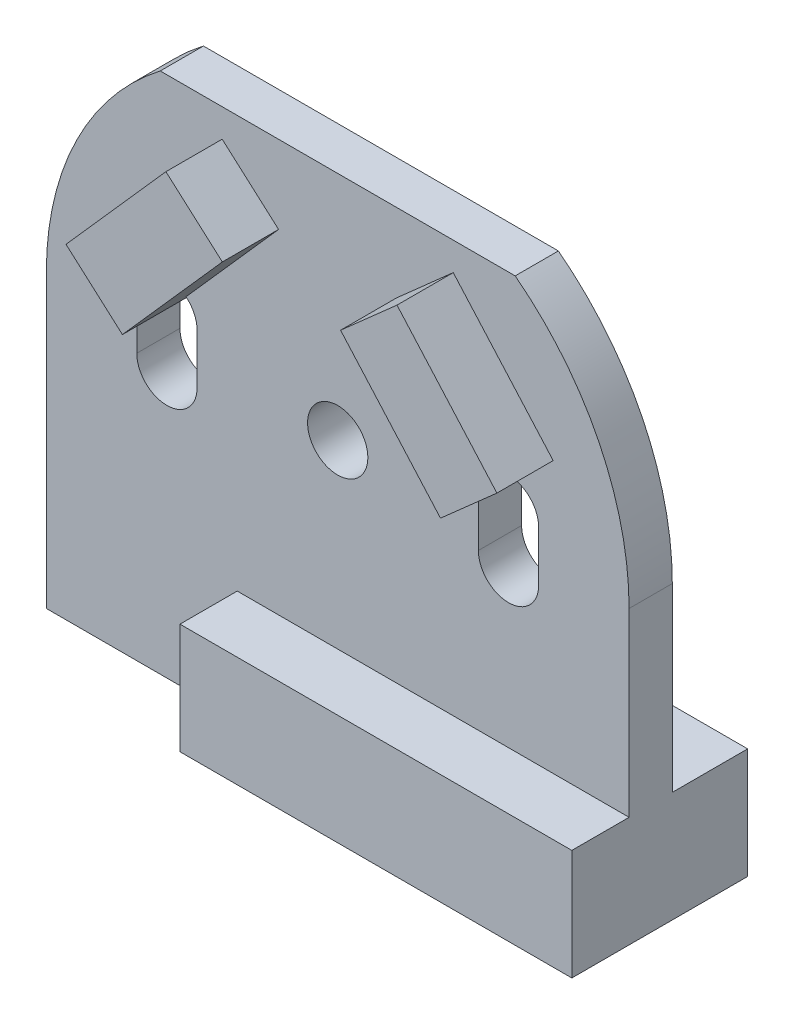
ISO-10303-21;
HEADER;
FILE_DESCRIPTION(('STEP AP214'),'2;1');
FILE_NAME('part.step','',(''),(''),'','','');
FILE_SCHEMA(('AUTOMOTIVE_DESIGN { 1 0 10303 214 1 1 1 1 }'));
ENDSEC;
DATA;
#1=APPLICATION_CONTEXT('core data for automotive mechanical design processes');
#2=APPLICATION_PROTOCOL_DEFINITION('international standard','automotive_design',2000,#1);
#3=PRODUCT_CONTEXT('',#1,'mechanical');
#4=PRODUCT('Part','Part','',(#3));
#5=PRODUCT_RELATED_PRODUCT_CATEGORY('part','',(#4));
#6=PRODUCT_DEFINITION_FORMATION('','',#4);
#7=PRODUCT_DEFINITION_CONTEXT('part definition',#1,'design');
#8=PRODUCT_DEFINITION('design','',#6,#7);
#9=PRODUCT_DEFINITION_SHAPE('','',#8);
#10=(LENGTH_UNIT() NAMED_UNIT(*) SI_UNIT(.MILLI.,.METRE.));
#11=(NAMED_UNIT(*) PLANE_ANGLE_UNIT() SI_UNIT($,.RADIAN.));
#12=(NAMED_UNIT(*) SI_UNIT($,.STERADIAN.) SOLID_ANGLE_UNIT());
#13=UNCERTAINTY_MEASURE_WITH_UNIT(LENGTH_MEASURE(1.E-05),#10,'distance_accuracy_value','');
#14=(GEOMETRIC_REPRESENTATION_CONTEXT(3) GLOBAL_UNCERTAINTY_ASSIGNED_CONTEXT((#13)) GLOBAL_UNIT_ASSIGNED_CONTEXT((#10,
#11,#12)) REPRESENTATION_CONTEXT('',''));
#15=CARTESIAN_POINT('',(0.,0.,0.));
#16=DIRECTION('',(0.,0.,1.));
#17=DIRECTION('',(1.,0.,0.));
#18=AXIS2_PLACEMENT_3D('',#15,#16,#17);
#19=CARTESIAN_POINT('',(3.4,0.5,0.86));
#20=DIRECTION('',(0.,0.,-1.));
#21=DIRECTION('',(-1.,0.,0.));
#22=AXIS2_PLACEMENT_3D('',#19,#20,#21);
#23=CYLINDRICAL_SURFACE('',#22,0.6);
#24=DIRECTION('',(0.,0.,-1.));
#25=VECTOR('',#24,1.);
#26=CARTESIAN_POINT('',(3.01971988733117,0.964098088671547,0.86));
#27=LINE('',#26,#25);
#28=CARTESIAN_POINT('',(3.01971988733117,0.964098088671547,0.86));
#29=VERTEX_POINT('',#28);
#30=CARTESIAN_POINT('',(3.01971988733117,0.964098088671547,0.));
#31=VERTEX_POINT('',#30);
#32=EDGE_CURVE('E363',#29,#31,#27,.T.);
#33=ORIENTED_EDGE('',*,*,#32,.F.);
#34=CARTESIAN_POINT('',(3.4,0.5,0.86));
#35=DIRECTION('',(0.,0.,1.));
#36=DIRECTION('',(1.,0.,0.));
#37=AXIS2_PLACEMENT_3D('',#34,#35,#36);
#38=CIRCLE('',#37,0.6);
#39=CARTESIAN_POINT('',(2.8,0.5,0.86));
#40=VERTEX_POINT('',#39);
#41=EDGE_CURVE('E453',#29,#40,#38,.T.);
#42=ORIENTED_EDGE('',*,*,#41,.T.);
#43=DIRECTION('',(0.,0.,-1.));
#44=VECTOR('',#43,1.);
#45=CARTESIAN_POINT('',(2.8,0.5,0.86));
#46=LINE('',#45,#44);
#47=CARTESIAN_POINT('',(2.8,0.5,0.));
#48=VERTEX_POINT('',#47);
#49=EDGE_CURVE('E566',#40,#48,#46,.T.);
#50=ORIENTED_EDGE('',*,*,#49,.T.);
#51=CARTESIAN_POINT('',(3.4,0.5,0.));
#52=DIRECTION('',(0.,0.,1.));
#53=DIRECTION('',(1.,0.,0.));
#54=AXIS2_PLACEMENT_3D('',#51,#52,#53);
#55=CIRCLE('',#54,0.6);
#56=EDGE_CURVE('E508',#31,#48,#55,.T.);
#57=ORIENTED_EDGE('',*,*,#56,.F.);
#58=EDGE_LOOP('',(#33,#42,#50,#57));
#59=FACE_BOUND('',#58,.T.);
#60=ADVANCED_FACE('F41',(#59),#23,.F.);
#61=CARTESIAN_POINT('',(-3.4,0.5,0.86));
#62=DIRECTION('',(0.,0.,-1.));
#63=DIRECTION('',(-1.,0.,0.));
#64=AXIS2_PLACEMENT_3D('',#61,#62,#63);
#65=CYLINDRICAL_SURFACE('',#64,0.6);
#66=CARTESIAN_POINT('',(-3.4,0.5,0.));
#67=DIRECTION('',(0.,0.,1.));
#68=DIRECTION('',(1.,0.,0.));
#69=AXIS2_PLACEMENT_3D('',#66,#67,#68);
#70=CIRCLE('',#69,0.6);
#71=CARTESIAN_POINT('',(-3.49641039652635,1.09220354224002,0.));
#72=VERTEX_POINT('',#71);
#73=CARTESIAN_POINT('',(-4.,0.5,0.));
#74=VERTEX_POINT('',#73);
#75=EDGE_CURVE('E428',#72,#74,#70,.T.);
#76=ORIENTED_EDGE('',*,*,#75,.F.);
#77=DIRECTION('',(0.,0.,-1.));
#78=VECTOR('',#77,1.);
#79=CARTESIAN_POINT('',(-3.49641039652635,1.09220354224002,0.86));
#80=LINE('',#79,#78);
#81=CARTESIAN_POINT('',(-3.49641039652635,1.09220354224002,0.86));
#82=VERTEX_POINT('',#81);
#83=EDGE_CURVE('E424',#72,#82,#80,.F.);
#84=ORIENTED_EDGE('',*,*,#83,.T.);
#85=CARTESIAN_POINT('',(-3.4,0.5,0.86));
#86=DIRECTION('',(0.,0.,1.));
#87=DIRECTION('',(1.,0.,0.));
#88=AXIS2_PLACEMENT_3D('',#85,#86,#87);
#89=CIRCLE('',#88,0.6);
#90=CARTESIAN_POINT('',(-4.,0.5,0.86));
#91=VERTEX_POINT('',#90);
#92=EDGE_CURVE('E434',#82,#91,#89,.T.);
#93=ORIENTED_EDGE('',*,*,#92,.T.);
#94=DIRECTION('',(0.,0.,-1.));
#95=VECTOR('',#94,1.);
#96=CARTESIAN_POINT('',(-4.,0.5,0.86));
#97=LINE('',#96,#95);
#98=EDGE_CURVE('E572',#91,#74,#97,.T.);
#99=ORIENTED_EDGE('',*,*,#98,.T.);
#100=EDGE_LOOP('',(#76,#84,#93,#99));
#101=FACE_BOUND('',#100,.T.);
#102=ADVANCED_FACE('F43',(#101),#65,.F.);
#103=CARTESIAN_POINT('',(-2.8,0.5,0.86));
#104=VERTEX_POINT('',#103);
#105=CARTESIAN_POINT('',(-3.01971988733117,0.964098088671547,0.86));
#106=VERTEX_POINT('',#105);
#107=EDGE_CURVE('E429',#104,#106,#89,.T.);
#108=ORIENTED_EDGE('',*,*,#107,.T.);
#109=DIRECTION('',(0.,0.,-1.));
#110=VECTOR('',#109,1.);
#111=CARTESIAN_POINT('',(-3.01971988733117,0.964098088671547,0.86));
#112=LINE('',#111,#110);
#113=CARTESIAN_POINT('',(-3.01971988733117,0.964098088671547,0.));
#114=VERTEX_POINT('',#113);
#115=EDGE_CURVE('E416',#106,#114,#112,.T.);
#116=ORIENTED_EDGE('',*,*,#115,.T.);
#117=CARTESIAN_POINT('',(-2.8,0.5,0.));
#118=VERTEX_POINT('',#117);
#119=EDGE_CURVE('E484',#118,#114,#70,.T.);
#120=ORIENTED_EDGE('',*,*,#119,.F.);
#121=DIRECTION('',(0.,0.,-1.));
#122=VECTOR('',#121,1.);
#123=CARTESIAN_POINT('',(-2.8,0.5,0.86));
#124=LINE('',#123,#122);
#125=EDGE_CURVE('E563',#104,#118,#124,.T.);
#126=ORIENTED_EDGE('',*,*,#125,.F.);
#127=EDGE_LOOP('',(#108,#116,#120,#126));
#128=FACE_BOUND('',#127,.T.);
#129=ADVANCED_FACE('F646',(#128),#65,.F.);
#130=CARTESIAN_POINT('',(0.,0.,0.86));
#131=DIRECTION('',(0.,0.,1.));
#132=DIRECTION('',(1.,0.,0.));
#133=AXIS2_PLACEMENT_3D('',#130,#131,#132);
#134=PLANE('',#133);
#135=DIRECTION('',(0.,-1.,0.));
#136=VECTOR('',#135,1.);
#137=CARTESIAN_POINT('',(-2.,0.,0.86));
#138=LINE('',#137,#136);
#139=CARTESIAN_POINT('',(-2.,-3.6,0.86));
#140=VERTEX_POINT('',#139);
#141=CARTESIAN_POINT('',(-2.,-5.8,0.86));
#142=VERTEX_POINT('',#141);
#143=EDGE_CURVE('E310',#140,#142,#138,.T.);
#144=ORIENTED_EDGE('',*,*,#143,.F.);
#145=DIRECTION('',(1.,0.,0.));
#146=VECTOR('',#145,1.);
#147=CARTESIAN_POINT('',(0.,-3.6,0.86));
#148=LINE('',#147,#146);
#149=CARTESIAN_POINT('',(5.8,-3.6,0.86));
#150=VERTEX_POINT('',#149);
#151=EDGE_CURVE('E307',#140,#150,#148,.T.);
#152=ORIENTED_EDGE('',*,*,#151,.T.);
#153=DIRECTION('',(0.,1.,0.));
#154=VECTOR('',#153,1.);
#155=CARTESIAN_POINT('',(5.8,0.,0.86));
#156=LINE('',#155,#154);
#157=CARTESIAN_POINT('',(5.8,0.,0.86));
#158=VERTEX_POINT('',#157);
#159=EDGE_CURVE('E481',#150,#158,#156,.T.);
#160=ORIENTED_EDGE('',*,*,#159,.T.);
#161=CARTESIAN_POINT('',(0.,0.,0.86));
#162=DIRECTION('',(0.,0.,1.));
#163=DIRECTION('',(1.,0.,0.));
#164=AXIS2_PLACEMENT_3D('',#161,#162,#163);
#165=CIRCLE('',#164,5.8);
#166=CARTESIAN_POINT('',(3.53270434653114,4.6,0.86));
#167=VERTEX_POINT('',#166);
#168=EDGE_CURVE('E473',#158,#167,#165,.T.);
#169=ORIENTED_EDGE('',*,*,#168,.T.);
#170=DIRECTION('',(1.,0.,0.));
#171=VECTOR('',#170,1.);
#172=CARTESIAN_POINT('',(0.,4.6,0.86));
#173=LINE('',#172,#171);
#174=CARTESIAN_POINT('',(-3.53270434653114,4.6,0.86));
#175=VERTEX_POINT('',#174);
#176=EDGE_CURVE('E465',#175,#167,#173,.T.);
#177=ORIENTED_EDGE('',*,*,#176,.F.);
#178=CARTESIAN_POINT('',(-5.8,0.,0.86));
#179=VERTEX_POINT('',#178);
#180=EDGE_CURVE('E469',#175,#179,#165,.T.);
#181=ORIENTED_EDGE('',*,*,#180,.T.);
#182=DIRECTION('',(0.,1.,0.));
#183=VECTOR('',#182,1.);
#184=CARTESIAN_POINT('',(-5.8,0.,0.86));
#185=LINE('',#184,#183);
#186=CARTESIAN_POINT('',(-5.8,-5.8,0.86));
#187=VERTEX_POINT('',#186);
#188=EDGE_CURVE('E472',#187,#179,#185,.T.);
#189=ORIENTED_EDGE('',*,*,#188,.F.);
#190=DIRECTION('',(1.,0.,0.));
#191=VECTOR('',#190,1.);
#192=CARTESIAN_POINT('',(0.,-5.8,0.86));
#193=LINE('',#192,#191);
#194=EDGE_CURVE('E477',#187,#142,#193,.T.);
#195=ORIENTED_EDGE('',*,*,#194,.T.);
#196=EDGE_LOOP('',(#144,#152,#160,#169,#177,#181,#189,#195));
#197=FACE_BOUND('',#196,.T.);
#198=DIRECTION('',(0.662893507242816,-0.74871369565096,0.));
#199=VECTOR('',#198,1.);
#200=CARTESIAN_POINT('',(2.17126971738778,1.92239117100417,0.86));
#201=LINE('',#200,#199);
#202=CARTESIAN_POINT('',(1.17692945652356,3.04546171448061,0.86));
#203=VERTEX_POINT('',#202);
#204=EDGE_CURVE('E367',#203,#29,#201,.T.);
#205=ORIENTED_EDGE('',*,*,#204,.F.);
#206=DIRECTION('',(-0.74871369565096,-0.662893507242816,0.));
#207=VECTOR('',#206,1.);
#208=CARTESIAN_POINT('',(-0.994340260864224,1.12307054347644,0.86));
#209=LINE('',#208,#207);
#210=CARTESIAN_POINT('',(2.3,4.03980197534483,0.86));
#211=VERTEX_POINT('',#210);
#212=EDGE_CURVE('E351',#211,#203,#209,.T.);
#213=ORIENTED_EDGE('',*,*,#212,.F.);
#214=DIRECTION('',(-0.662893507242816,0.74871369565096,0.));
#215=VECTOR('',#214,1.);
#216=CARTESIAN_POINT('',(3.29434026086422,2.91673143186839,0.86));
#217=LINE('',#216,#215);
#218=CARTESIAN_POINT('',(4.28868052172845,1.79366088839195,0.86));
#219=VERTEX_POINT('',#218);
#220=EDGE_CURVE('E354',#219,#211,#217,.T.);
#221=ORIENTED_EDGE('',*,*,#220,.F.);
#222=DIRECTION('',(0.74871369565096,0.662893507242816,0.));
#223=VECTOR('',#222,1.);
#224=CARTESIAN_POINT('',(0.994340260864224,-1.12307054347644,0.86));
#225=LINE('',#224,#223);
#226=CARTESIAN_POINT('',(3.49641039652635,1.09220354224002,0.86));
#227=VERTEX_POINT('',#226);
#228=EDGE_CURVE('E360',#227,#219,#225,.T.);
#229=ORIENTED_EDGE('',*,*,#228,.F.);
#230=CARTESIAN_POINT('',(4.,0.5,0.86));
#231=VERTEX_POINT('',#230);
#232=EDGE_CURVE('E454',#231,#227,#38,.T.);
#233=ORIENTED_EDGE('',*,*,#232,.F.);
#234=DIRECTION('',(0.,-1.,0.));
#235=VECTOR('',#234,1.);
#236=CARTESIAN_POINT('',(4.,0.,0.86));
#237=LINE('',#236,#235);
#238=CARTESIAN_POINT('',(4.,-0.5,0.86));
#239=VERTEX_POINT('',#238);
#240=EDGE_CURVE('E458',#231,#239,#237,.T.);
#241=ORIENTED_EDGE('',*,*,#240,.T.);
#242=CARTESIAN_POINT('',(3.4,-0.5,0.86));
#243=DIRECTION('',(0.,0.,1.));
#244=DIRECTION('',(1.,0.,0.));
#245=AXIS2_PLACEMENT_3D('',#242,#243,#244);
#246=CIRCLE('',#245,0.6);
#247=CARTESIAN_POINT('',(2.8,-0.5,0.86));
#248=VERTEX_POINT('',#247);
#249=EDGE_CURVE('E445',#248,#239,#246,.T.);
#250=ORIENTED_EDGE('',*,*,#249,.F.);
#251=DIRECTION('',(0.,-1.,0.));
#252=VECTOR('',#251,1.);
#253=CARTESIAN_POINT('',(2.8,0.,0.86));
#254=LINE('',#253,#252);
#255=EDGE_CURVE('E449',#40,#248,#254,.T.);
#256=ORIENTED_EDGE('',*,*,#255,.F.);
#257=ORIENTED_EDGE('',*,*,#41,.F.);
#258=EDGE_LOOP('',(#205,#213,#221,#229,#233,#241,#250,#256,#257));
#259=FACE_BOUND('',#258,.T.);
#260=CARTESIAN_POINT('',(0.,0.,0.86));
#261=DIRECTION('',(0.,0.,1.));
#262=DIRECTION('',(1.,0.,0.));
#263=AXIS2_PLACEMENT_3D('',#260,#261,#262);
#264=CIRCLE('',#263,0.6);
#265=CARTESIAN_POINT('',(0.6,0.,0.86));
#266=VERTEX_POINT('',#265);
#267=EDGE_CURVE('E461',#266,#266,#264,.T.);
#268=ORIENTED_EDGE('',*,*,#267,.F.);
#269=EDGE_LOOP('',(#268));
#270=FACE_BOUND('',#269,.T.);
#271=ORIENTED_EDGE('',*,*,#92,.F.);
#272=DIRECTION('',(-0.74871369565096,0.662893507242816,0.));
#273=VECTOR('',#272,1.);
#274=CARTESIAN_POINT('',(-0.994340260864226,-1.12307054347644,0.86));
#275=LINE('',#274,#273);
#276=CARTESIAN_POINT('',(-4.28868052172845,1.79366088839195,0.86));
#277=VERTEX_POINT('',#276);
#278=EDGE_CURVE('E420',#82,#277,#275,.T.);
#279=ORIENTED_EDGE('',*,*,#278,.T.);
#280=DIRECTION('',(0.662893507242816,0.74871369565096,0.));
#281=VECTOR('',#280,1.);
#282=CARTESIAN_POINT('',(-3.29434026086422,2.91673143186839,0.86));
#283=LINE('',#282,#281);
#284=CARTESIAN_POINT('',(-2.3,4.03980197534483,0.86));
#285=VERTEX_POINT('',#284);
#286=EDGE_CURVE('E404',#277,#285,#283,.T.);
#287=ORIENTED_EDGE('',*,*,#286,.T.);
#288=DIRECTION('',(0.748713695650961,-0.662893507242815,0.));
#289=VECTOR('',#288,1.);
#290=CARTESIAN_POINT('',(0.994340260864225,1.12307054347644,0.86));
#291=LINE('',#290,#289);
#292=CARTESIAN_POINT('',(-1.17692945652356,3.04546171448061,0.86));
#293=VERTEX_POINT('',#292);
#294=EDGE_CURVE('E408',#285,#293,#291,.T.);
#295=ORIENTED_EDGE('',*,*,#294,.T.);
#296=DIRECTION('',(-0.662893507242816,-0.74871369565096,0.));
#297=VECTOR('',#296,1.);
#298=CARTESIAN_POINT('',(-2.17126971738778,1.92239117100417,0.86));
#299=LINE('',#298,#297);
#300=EDGE_CURVE('E412',#293,#106,#299,.T.);
#301=ORIENTED_EDGE('',*,*,#300,.T.);
#302=ORIENTED_EDGE('',*,*,#107,.F.);
#303=DIRECTION('',(0.,-1.,0.));
#304=VECTOR('',#303,1.);
#305=CARTESIAN_POINT('',(-2.8,0.,0.86));
#306=LINE('',#305,#304);
#307=CARTESIAN_POINT('',(-2.8,-0.5,0.86));
#308=VERTEX_POINT('',#307);
#309=EDGE_CURVE('E433',#104,#308,#306,.T.);
#310=ORIENTED_EDGE('',*,*,#309,.T.);
#311=CARTESIAN_POINT('',(-3.4,-0.5,0.86));
#312=DIRECTION('',(0.,0.,1.));
#313=DIRECTION('',(1.,0.,0.));
#314=AXIS2_PLACEMENT_3D('',#311,#312,#313);
#315=CIRCLE('',#314,0.6);
#316=CARTESIAN_POINT('',(-4.,-0.5,0.86));
#317=VERTEX_POINT('',#316);
#318=EDGE_CURVE('E437',#317,#308,#315,.T.);
#319=ORIENTED_EDGE('',*,*,#318,.F.);
#320=DIRECTION('',(0.,-1.,0.));
#321=VECTOR('',#320,1.);
#322=CARTESIAN_POINT('',(-4.,0.,0.86));
#323=LINE('',#322,#321);
#324=EDGE_CURVE('E441',#91,#317,#323,.T.);
#325=ORIENTED_EDGE('',*,*,#324,.F.);
#326=EDGE_LOOP('',(#271,#279,#287,#295,#301,#302,#310,#319,#325));
#327=FACE_BOUND('',#326,.T.);
#328=ADVANCED_FACE('F605',(#197,#259,#270,#327),#134,.T.);
#329=CARTESIAN_POINT('',(0.,4.6,0.86));
#330=DIRECTION('',(0.,1.,0.));
#331=DIRECTION('',(0.,0.,1.));
#332=AXIS2_PLACEMENT_3D('',#329,#330,#331);
#333=PLANE('',#332);
#334=DIRECTION('',(1.,0.,0.));
#335=VECTOR('',#334,1.);
#336=CARTESIAN_POINT('',(0.,4.6,0.));
#337=LINE('',#336,#335);
#338=CARTESIAN_POINT('',(-3.53270434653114,4.6,0.));
#339=VERTEX_POINT('',#338);
#340=CARTESIAN_POINT('',(3.53270434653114,4.6,0.));
#341=VERTEX_POINT('',#340);
#342=EDGE_CURVE('E521',#339,#341,#337,.T.);
#343=ORIENTED_EDGE('',*,*,#342,.F.);
#344=DIRECTION('',(0.,0.,-1.));
#345=VECTOR('',#344,1.);
#346=CARTESIAN_POINT('',(-3.53270434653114,4.6,0.86));
#347=LINE('',#346,#345);
#348=EDGE_CURVE('E556',#175,#339,#347,.T.);
#349=ORIENTED_EDGE('',*,*,#348,.F.);
#350=ORIENTED_EDGE('',*,*,#176,.T.);
#351=DIRECTION('',(0.,0.,-1.));
#352=VECTOR('',#351,1.);
#353=CARTESIAN_POINT('',(3.53270434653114,4.6,0.86));
#354=LINE('',#353,#352);
#355=EDGE_CURVE('E539',#167,#341,#354,.T.);
#356=ORIENTED_EDGE('',*,*,#355,.T.);
#357=EDGE_LOOP('',(#343,#349,#350,#356));
#358=FACE_BOUND('',#357,.T.);
#359=ADVANCED_FACE('F612',(#358),#333,.T.);
#360=CARTESIAN_POINT('',(0.,0.,0.86));
#361=DIRECTION('',(0.,0.,-1.));
#362=DIRECTION('',(-1.,0.,0.));
#363=AXIS2_PLACEMENT_3D('',#360,#361,#362);
#364=CYLINDRICAL_SURFACE('',#363,5.8);
#365=CARTESIAN_POINT('',(0.,0.,0.));
#366=DIRECTION('',(0.,0.,1.));
#367=DIRECTION('',(1.,0.,0.));
#368=AXIS2_PLACEMENT_3D('',#365,#366,#367);
#369=CIRCLE('',#368,5.8);
#370=CARTESIAN_POINT('',(-5.8,0.,0.));
#371=VERTEX_POINT('',#370);
#372=EDGE_CURVE('E525',#339,#371,#369,.T.);
#373=ORIENTED_EDGE('',*,*,#372,.T.);
#374=DIRECTION('',(0.,0.,-1.));
#375=VECTOR('',#374,1.);
#376=CARTESIAN_POINT('',(-5.8,0.,0.86));
#377=LINE('',#376,#375);
#378=EDGE_CURVE('E553',#179,#371,#377,.T.);
#379=ORIENTED_EDGE('',*,*,#378,.F.);
#380=ORIENTED_EDGE('',*,*,#180,.F.);
#381=ORIENTED_EDGE('',*,*,#348,.T.);
#382=EDGE_LOOP('',(#373,#379,#380,#381));
#383=FACE_BOUND('',#382,.T.);
#384=ADVANCED_FACE('F617',(#383),#364,.T.);
#385=CARTESIAN_POINT('',(-5.8,0.,0.86));
#386=DIRECTION('',(-1.,0.,0.));
#387=DIRECTION('',(0.,0.,1.));
#388=AXIS2_PLACEMENT_3D('',#385,#386,#387);
#389=PLANE('',#388);
#390=DIRECTION('',(0.,1.,0.));
#391=VECTOR('',#390,1.);
#392=CARTESIAN_POINT('',(-5.8,0.,0.));
#393=LINE('',#392,#391);
#394=CARTESIAN_POINT('',(-5.8,-5.8,0.));
#395=VERTEX_POINT('',#394);
#396=EDGE_CURVE('E529',#395,#371,#393,.T.);
#397=ORIENTED_EDGE('',*,*,#396,.F.);
#398=DIRECTION('',(0.,0.,-1.));
#399=VECTOR('',#398,1.);
#400=CARTESIAN_POINT('',(-5.8,-5.8,0.86));
#401=LINE('',#400,#399);
#402=EDGE_CURVE('E550',#187,#395,#401,.T.);
#403=ORIENTED_EDGE('',*,*,#402,.F.);
#404=ORIENTED_EDGE('',*,*,#188,.T.);
#405=ORIENTED_EDGE('',*,*,#378,.T.);
#406=EDGE_LOOP('',(#397,#403,#404,#405));
#407=FACE_BOUND('',#406,.T.);
#408=ADVANCED_FACE('F622',(#407),#389,.T.);
#409=CARTESIAN_POINT('',(0.,-5.8,0.86));
#410=DIRECTION('',(0.,1.,0.));
#411=DIRECTION('',(0.,0.,1.));
#412=AXIS2_PLACEMENT_3D('',#409,#410,#411);
#413=PLANE('',#412);
#414=DIRECTION('',(1.,0.,0.));
#415=VECTOR('',#414,1.);
#416=CARTESIAN_POINT('',(0.,-5.8,0.));
#417=LINE('',#416,#415);
#418=CARTESIAN_POINT('',(-2.,-5.8,0.));
#419=VERTEX_POINT('',#418);
#420=EDGE_CURVE('E257',#395,#419,#417,.T.);
#421=ORIENTED_EDGE('',*,*,#420,.T.);
#422=DIRECTION('',(0.,0.,-1.));
#423=VECTOR('',#422,1.);
#424=CARTESIAN_POINT('',(-2.,-5.8,2.));
#425=LINE('',#424,#423);
#426=CARTESIAN_POINT('',(-2.,-5.8,-1.5));
#427=VERTEX_POINT('',#426);
#428=EDGE_CURVE('E251',#419,#427,#425,.T.);
#429=ORIENTED_EDGE('',*,*,#428,.T.);
#430=DIRECTION('',(1.,0.,0.));
#431=VECTOR('',#430,1.);
#432=CARTESIAN_POINT('',(0.,-5.8,-1.5));
#433=LINE('',#432,#431);
#434=CARTESIAN_POINT('',(5.8,-5.8,-1.5));
#435=VERTEX_POINT('',#434);
#436=EDGE_CURVE('E255',#427,#435,#433,.T.);
#437=ORIENTED_EDGE('',*,*,#436,.T.);
#438=DIRECTION('',(0.,0.,-1.));
#439=VECTOR('',#438,1.);
#440=CARTESIAN_POINT('',(5.8,-5.8,0.86));
#441=LINE('',#440,#439);
#442=CARTESIAN_POINT('',(5.8,-5.8,2.));
#443=VERTEX_POINT('',#442);
#444=EDGE_CURVE('E547',#443,#435,#441,.T.);
#445=ORIENTED_EDGE('',*,*,#444,.F.);
#446=DIRECTION('',(1.,0.,0.));
#447=VECTOR('',#446,1.);
#448=CARTESIAN_POINT('',(0.,-5.8,2.));
#449=LINE('',#448,#447);
#450=CARTESIAN_POINT('',(-2.,-5.8,2.));
#451=VERTEX_POINT('',#450);
#452=EDGE_CURVE('E288',#451,#443,#449,.T.);
#453=ORIENTED_EDGE('',*,*,#452,.F.);
#454=EDGE_CURVE('E260',#451,#142,#425,.T.);
#455=ORIENTED_EDGE('',*,*,#454,.T.);
#456=ORIENTED_EDGE('',*,*,#194,.F.);
#457=ORIENTED_EDGE('',*,*,#402,.T.);
#458=EDGE_LOOP('',(#421,#429,#437,#445,#453,#455,#456,#457));
#459=FACE_BOUND('',#458,.T.);
#460=ADVANCED_FACE('F253',(#459),#413,.F.);
#461=CARTESIAN_POINT('',(5.8,0.,0.86));
#462=DIRECTION('',(-1.,0.,0.));
#463=DIRECTION('',(0.,0.,1.));
#464=AXIS2_PLACEMENT_3D('',#461,#462,#463);
#465=PLANE('',#464);
#466=ORIENTED_EDGE('',*,*,#444,.T.);
#467=DIRECTION('',(0.,1.,0.));
#468=VECTOR('',#467,1.);
#469=CARTESIAN_POINT('',(5.8,0.,-1.5));
#470=LINE('',#469,#468);
#471=CARTESIAN_POINT('',(5.8,-3.6,-1.5));
#472=VERTEX_POINT('',#471);
#473=EDGE_CURVE('E275',#435,#472,#470,.T.);
#474=ORIENTED_EDGE('',*,*,#473,.T.);
#475=DIRECTION('',(0.,0.,-1.));
#476=VECTOR('',#475,1.);
#477=CARTESIAN_POINT('',(5.8,-3.6,2.));
#478=LINE('',#477,#476);
#479=CARTESIAN_POINT('',(5.8,-3.6,0.));
#480=VERTEX_POINT('',#479);
#481=EDGE_CURVE('E302',#480,#472,#478,.T.);
#482=ORIENTED_EDGE('',*,*,#481,.F.);
#483=DIRECTION('',(0.,1.,0.));
#484=VECTOR('',#483,1.);
#485=CARTESIAN_POINT('',(5.8,0.,0.));
#486=LINE('',#485,#484);
#487=CARTESIAN_POINT('',(5.8,0.,0.));
#488=VERTEX_POINT('',#487);
#489=EDGE_CURVE('E536',#480,#488,#486,.T.);
#490=ORIENTED_EDGE('',*,*,#489,.T.);
#491=DIRECTION('',(0.,0.,-1.));
#492=VECTOR('',#491,1.);
#493=CARTESIAN_POINT('',(5.8,0.,0.86));
#494=LINE('',#493,#492);
#495=EDGE_CURVE('E542',#158,#488,#494,.T.);
#496=ORIENTED_EDGE('',*,*,#495,.F.);
#497=ORIENTED_EDGE('',*,*,#159,.F.);
#498=CARTESIAN_POINT('',(5.8,-3.6,2.));
#499=VERTEX_POINT('',#498);
#500=EDGE_CURVE('E57',#499,#150,#478,.T.);
#501=ORIENTED_EDGE('',*,*,#500,.F.);
#502=DIRECTION('',(0.,1.,0.));
#503=VECTOR('',#502,1.);
#504=CARTESIAN_POINT('',(5.8,0.,2.));
#505=LINE('',#504,#503);
#506=EDGE_CURVE('E292',#443,#499,#505,.T.);
#507=ORIENTED_EDGE('',*,*,#506,.F.);
#508=EDGE_LOOP('',(#466,#474,#482,#490,#496,#497,#501,#507));
#509=FACE_BOUND('',#508,.T.);
#510=ADVANCED_FACE('F588',(#509),#465,.F.);
#511=CARTESIAN_POINT('',(3.4,-0.5,0.86));
#512=DIRECTION('',(0.,0.,-1.));
#513=DIRECTION('',(-1.,0.,0.));
#514=AXIS2_PLACEMENT_3D('',#511,#512,#513);
#515=CYLINDRICAL_SURFACE('',#514,0.6);
#516=CARTESIAN_POINT('',(3.4,-0.5,0.));
#517=DIRECTION('',(0.,0.,1.));
#518=DIRECTION('',(1.,0.,0.));
#519=AXIS2_PLACEMENT_3D('',#516,#517,#518);
#520=CIRCLE('',#519,0.6);
#521=CARTESIAN_POINT('',(2.8,-0.5,0.));
#522=VERTEX_POINT('',#521);
#523=CARTESIAN_POINT('',(4.,-0.5,0.));
#524=VERTEX_POINT('',#523);
#525=EDGE_CURVE('E500',#522,#524,#520,.T.);
#526=ORIENTED_EDGE('',*,*,#525,.F.);
#527=DIRECTION('',(0.,0.,-1.));
#528=VECTOR('',#527,1.);
#529=CARTESIAN_POINT('',(2.8,-0.5,0.86));
#530=LINE('',#529,#528);
#531=EDGE_CURVE('E543',#248,#522,#530,.T.);
#532=ORIENTED_EDGE('',*,*,#531,.F.);
#533=ORIENTED_EDGE('',*,*,#249,.T.);
#534=DIRECTION('',(0.,0.,-1.));
#535=VECTOR('',#534,1.);
#536=CARTESIAN_POINT('',(4.,-0.5,0.86));
#537=LINE('',#536,#535);
#538=EDGE_CURVE('E559',#239,#524,#537,.T.);
#539=ORIENTED_EDGE('',*,*,#538,.T.);
#540=EDGE_LOOP('',(#526,#532,#533,#539));
#541=FACE_BOUND('',#540,.T.);
#542=ADVANCED_FACE('F661',(#541),#515,.F.);
#543=CARTESIAN_POINT('',(2.8,0.,0.86));
#544=DIRECTION('',(1.,0.,0.));
#545=DIRECTION('',(0.,0.,-1.));
#546=AXIS2_PLACEMENT_3D('',#543,#544,#545);
#547=PLANE('',#546);
#548=DIRECTION('',(0.,-1.,0.));
#549=VECTOR('',#548,1.);
#550=CARTESIAN_POINT('',(2.8,0.,0.));
#551=LINE('',#550,#549);
#552=EDGE_CURVE('E504',#48,#522,#551,.T.);
#553=ORIENTED_EDGE('',*,*,#552,.F.);
#554=ORIENTED_EDGE('',*,*,#49,.F.);
#555=ORIENTED_EDGE('',*,*,#255,.T.);
#556=ORIENTED_EDGE('',*,*,#531,.T.);
#557=EDGE_LOOP('',(#553,#554,#555,#556));
#558=FACE_BOUND('',#557,.T.);
#559=ADVANCED_FACE('F653',(#558),#547,.T.);
#560=DIRECTION('',(0.,0.,-1.));
#561=VECTOR('',#560,1.);
#562=CARTESIAN_POINT('',(3.49641039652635,1.09220354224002,0.86));
#563=LINE('',#562,#561);
#564=CARTESIAN_POINT('',(3.49641039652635,1.09220354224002,0.));
#565=VERTEX_POINT('',#564);
#566=EDGE_CURVE('E357',#565,#227,#563,.F.);
#567=ORIENTED_EDGE('',*,*,#566,.F.);
#568=CARTESIAN_POINT('',(4.,0.5,0.));
#569=VERTEX_POINT('',#568);
#570=EDGE_CURVE('E509',#569,#565,#55,.T.);
#571=ORIENTED_EDGE('',*,*,#570,.F.);
#572=DIRECTION('',(0.,0.,-1.));
#573=VECTOR('',#572,1.);
#574=CARTESIAN_POINT('',(4.,0.5,0.86));
#575=LINE('',#574,#573);
#576=EDGE_CURVE('E562',#231,#569,#575,.T.);
#577=ORIENTED_EDGE('',*,*,#576,.F.);
#578=ORIENTED_EDGE('',*,*,#232,.T.);
#579=EDGE_LOOP('',(#567,#571,#577,#578));
#580=FACE_BOUND('',#579,.T.);
#581=ADVANCED_FACE('F642',(#580),#23,.F.);
#582=CARTESIAN_POINT('',(-2.8,0.,0.86));
#583=DIRECTION('',(1.,0.,0.));
#584=DIRECTION('',(0.,0.,-1.));
#585=AXIS2_PLACEMENT_3D('',#582,#583,#584);
#586=PLANE('',#585);
#587=DIRECTION('',(0.,-1.,0.));
#588=VECTOR('',#587,1.);
#589=CARTESIAN_POINT('',(-2.8,0.,0.));
#590=LINE('',#589,#588);
#591=CARTESIAN_POINT('',(-2.8,-0.5,0.));
#592=VERTEX_POINT('',#591);
#593=EDGE_CURVE('E488',#118,#592,#590,.T.);
#594=ORIENTED_EDGE('',*,*,#593,.T.);
#595=DIRECTION('',(0.,0.,-1.));
#596=VECTOR('',#595,1.);
#597=CARTESIAN_POINT('',(-2.8,-0.5,0.86));
#598=LINE('',#597,#596);
#599=EDGE_CURVE('E579',#308,#592,#598,.T.);
#600=ORIENTED_EDGE('',*,*,#599,.F.);
#601=ORIENTED_EDGE('',*,*,#309,.F.);
#602=ORIENTED_EDGE('',*,*,#125,.T.);
#603=EDGE_LOOP('',(#594,#600,#601,#602));
#604=FACE_BOUND('',#603,.T.);
#605=ADVANCED_FACE('F652',(#604),#586,.F.);
#606=CARTESIAN_POINT('',(-3.4,-0.5,0.86));
#607=DIRECTION('',(0.,0.,-1.));
#608=DIRECTION('',(-1.,0.,0.));
#609=AXIS2_PLACEMENT_3D('',#606,#607,#608);
#610=CYLINDRICAL_SURFACE('',#609,0.6);
#611=CARTESIAN_POINT('',(-3.4,-0.5,0.));
#612=DIRECTION('',(0.,0.,1.));
#613=DIRECTION('',(1.,0.,0.));
#614=AXIS2_PLACEMENT_3D('',#611,#612,#613);
#615=CIRCLE('',#614,0.6);
#616=CARTESIAN_POINT('',(-4.,-0.5,0.));
#617=VERTEX_POINT('',#616);
#618=EDGE_CURVE('E492',#617,#592,#615,.T.);
#619=ORIENTED_EDGE('',*,*,#618,.F.);
#620=DIRECTION('',(0.,0.,-1.));
#621=VECTOR('',#620,1.);
#622=CARTESIAN_POINT('',(-4.,-0.5,0.86));
#623=LINE('',#622,#621);
#624=EDGE_CURVE('E576',#317,#617,#623,.T.);
#625=ORIENTED_EDGE('',*,*,#624,.F.);
#626=ORIENTED_EDGE('',*,*,#318,.T.);
#627=ORIENTED_EDGE('',*,*,#599,.T.);
#628=EDGE_LOOP('',(#619,#625,#626,#627));
#629=FACE_BOUND('',#628,.T.);
#630=ADVANCED_FACE('F659',(#629),#610,.F.);
#631=CARTESIAN_POINT('',(0.,0.,0.86));
#632=DIRECTION('',(0.,0.,-1.));
#633=DIRECTION('',(-1.,0.,0.));
#634=AXIS2_PLACEMENT_3D('',#631,#632,#633);
#635=CYLINDRICAL_SURFACE('',#634,0.6);
#636=ORIENTED_EDGE('',*,*,#267,.T.);
#637=EDGE_LOOP('',(#636));
#638=FACE_BOUND('',#637,.T.);
#639=CARTESIAN_POINT('',(0.,0.,0.));
#640=DIRECTION('',(0.,0.,1.));
#641=DIRECTION('',(1.,0.,0.));
#642=AXIS2_PLACEMENT_3D('',#639,#640,#641);
#643=CIRCLE('',#642,0.6);
#644=CARTESIAN_POINT('',(0.6,0.,0.));
#645=VERTEX_POINT('',#644);
#646=EDGE_CURVE('E517',#645,#645,#643,.T.);
#647=ORIENTED_EDGE('',*,*,#646,.F.);
#648=EDGE_LOOP('',(#647));
#649=FACE_BOUND('',#648,.T.);
#650=ADVANCED_FACE('F714',(#638,#649),#635,.F.);
#651=CARTESIAN_POINT('',(4.,0.,0.86));
#652=DIRECTION('',(1.,0.,0.));
#653=DIRECTION('',(0.,0.,-1.));
#654=AXIS2_PLACEMENT_3D('',#651,#652,#653);
#655=PLANE('',#654);
#656=DIRECTION('',(0.,-1.,0.));
#657=VECTOR('',#656,1.);
#658=CARTESIAN_POINT('',(4.,0.,0.));
#659=LINE('',#658,#657);
#660=EDGE_CURVE('E513',#569,#524,#659,.T.);
#661=ORIENTED_EDGE('',*,*,#660,.T.);
#662=ORIENTED_EDGE('',*,*,#538,.F.);
#663=ORIENTED_EDGE('',*,*,#240,.F.);
#664=ORIENTED_EDGE('',*,*,#576,.T.);
#665=EDGE_LOOP('',(#661,#662,#663,#664));
#666=FACE_BOUND('',#665,.T.);
#667=ADVANCED_FACE('F675',(#666),#655,.F.);
#668=CARTESIAN_POINT('',(-4.,0.,0.86));
#669=DIRECTION('',(1.,0.,0.));
#670=DIRECTION('',(0.,0.,-1.));
#671=AXIS2_PLACEMENT_3D('',#668,#669,#670);
#672=PLANE('',#671);
#673=DIRECTION('',(0.,-1.,0.));
#674=VECTOR('',#673,1.);
#675=CARTESIAN_POINT('',(-4.,0.,0.));
#676=LINE('',#675,#674);
#677=EDGE_CURVE('E496',#74,#617,#676,.T.);
#678=ORIENTED_EDGE('',*,*,#677,.F.);
#679=ORIENTED_EDGE('',*,*,#98,.F.);
#680=ORIENTED_EDGE('',*,*,#324,.T.);
#681=ORIENTED_EDGE('',*,*,#624,.T.);
#682=EDGE_LOOP('',(#678,#679,#680,#681));
#683=FACE_BOUND('',#682,.T.);
#684=ADVANCED_FACE('F709',(#683),#672,.T.);
#685=EDGE_CURVE('E530',#488,#341,#369,.T.);
#686=ORIENTED_EDGE('',*,*,#685,.T.);
#687=ORIENTED_EDGE('',*,*,#355,.F.);
#688=ORIENTED_EDGE('',*,*,#168,.F.);
#689=ORIENTED_EDGE('',*,*,#495,.T.);
#690=EDGE_LOOP('',(#686,#687,#688,#689));
#691=FACE_BOUND('',#690,.T.);
#692=ADVANCED_FACE('F609',(#691),#364,.T.);
#693=CARTESIAN_POINT('',(0.,0.,0.));
#694=DIRECTION('',(0.,0.,1.));
#695=DIRECTION('',(1.,0.,0.));
#696=AXIS2_PLACEMENT_3D('',#693,#694,#695);
#697=PLANE('',#696);
#698=ORIENTED_EDGE('',*,*,#570,.T.);
#699=DIRECTION('',(-0.74871369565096,-0.662893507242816,0.));
#700=VECTOR('',#699,1.);
#701=CARTESIAN_POINT('',(0.994340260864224,-1.12307054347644,0.));
#702=LINE('',#701,#700);
#703=CARTESIAN_POINT('',(3.16560997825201,0.799320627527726,0.));
#704=VERTEX_POINT('',#703);
#705=EDGE_CURVE('E319',#565,#704,#702,.T.);
#706=ORIENTED_EDGE('',*,*,#705,.T.);
#707=DIRECTION('',(-0.662893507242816,0.74871369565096,0.));
#708=VECTOR('',#707,1.);
#709=CARTESIAN_POINT('',(2.17126971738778,1.92239117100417,0.));
#710=LINE('',#709,#708);
#711=EDGE_CURVE('E313',#704,#31,#710,.T.);
#712=ORIENTED_EDGE('',*,*,#711,.T.);
#713=ORIENTED_EDGE('',*,*,#56,.T.);
#714=ORIENTED_EDGE('',*,*,#552,.T.);
#715=ORIENTED_EDGE('',*,*,#525,.T.);
#716=ORIENTED_EDGE('',*,*,#660,.F.);
#717=EDGE_LOOP('',(#698,#706,#712,#713,#714,#715,#716));
#718=FACE_BOUND('',#717,.T.);
#719=ORIENTED_EDGE('',*,*,#119,.T.);
#720=DIRECTION('',(0.662893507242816,0.74871369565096,0.));
#721=VECTOR('',#720,1.);
#722=CARTESIAN_POINT('',(-2.17126971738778,1.92239117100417,0.));
#723=LINE('',#722,#721);
#724=CARTESIAN_POINT('',(-3.16560997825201,0.799320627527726,0.));
#725=VERTEX_POINT('',#724);
#726=EDGE_CURVE('E376',#725,#114,#723,.T.);
#727=ORIENTED_EDGE('',*,*,#726,.F.);
#728=DIRECTION('',(0.74871369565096,-0.662893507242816,0.));
#729=VECTOR('',#728,1.);
#730=CARTESIAN_POINT('',(-0.994340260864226,-1.12307054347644,0.));
#731=LINE('',#730,#729);
#732=EDGE_CURVE('E370',#72,#725,#731,.T.);
#733=ORIENTED_EDGE('',*,*,#732,.F.);
#734=ORIENTED_EDGE('',*,*,#75,.T.);
#735=ORIENTED_EDGE('',*,*,#677,.T.);
#736=ORIENTED_EDGE('',*,*,#618,.T.);
#737=ORIENTED_EDGE('',*,*,#593,.F.);
#738=EDGE_LOOP('',(#719,#727,#733,#734,#735,#736,#737));
#739=FACE_BOUND('',#738,.T.);
#740=DIRECTION('',(1.,0.,0.));
#741=VECTOR('',#740,1.);
#742=CARTESIAN_POINT('',(0.,-3.6,0.));
#743=LINE('',#742,#741);
#744=CARTESIAN_POINT('',(-2.,-3.6,0.));
#745=VERTEX_POINT('',#744);
#746=EDGE_CURVE('E50',#745,#480,#743,.T.);
#747=ORIENTED_EDGE('',*,*,#746,.F.);
#748=DIRECTION('',(0.,-1.,0.));
#749=VECTOR('',#748,1.);
#750=CARTESIAN_POINT('',(-2.,0.,0.));
#751=LINE('',#750,#749);
#752=EDGE_CURVE('E11',#745,#419,#751,.T.);
#753=ORIENTED_EDGE('',*,*,#752,.T.);
#754=ORIENTED_EDGE('',*,*,#420,.F.);
#755=ORIENTED_EDGE('',*,*,#396,.T.);
#756=ORIENTED_EDGE('',*,*,#372,.F.);
#757=ORIENTED_EDGE('',*,*,#342,.T.);
#758=ORIENTED_EDGE('',*,*,#685,.F.);
#759=ORIENTED_EDGE('',*,*,#489,.F.);
#760=EDGE_LOOP('',(#747,#753,#754,#755,#756,#757,#758,#759));
#761=FACE_BOUND('',#760,.T.);
#762=ORIENTED_EDGE('',*,*,#646,.T.);
#763=EDGE_LOOP('',(#762));
#764=FACE_BOUND('',#763,.T.);
#765=ADVANCED_FACE('F670',(#718,#739,#761,#764),#697,.F.);
#766=CARTESIAN_POINT('',(-0.994340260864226,-1.12307054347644,1.98));
#767=DIRECTION('',(0.662893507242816,0.74871369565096,0.));
#768=DIRECTION('',(-0.74871369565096,0.662893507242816,0.));
#769=AXIS2_PLACEMENT_3D('',#766,#767,#768);
#770=PLANE('',#769);
#771=ORIENTED_EDGE('',*,*,#83,.F.);
#772=ORIENTED_EDGE('',*,*,#732,.T.);
#773=DIRECTION('',(0.,0.,-1.));
#774=VECTOR('',#773,1.);
#775=CARTESIAN_POINT('',(-3.16560997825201,0.799320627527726,1.98));
#776=LINE('',#775,#774);
#777=CARTESIAN_POINT('',(-3.16560997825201,0.799320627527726,1.98));
#778=VERTEX_POINT('',#777);
#779=EDGE_CURVE('E400',#778,#725,#776,.T.);
#780=ORIENTED_EDGE('',*,*,#779,.F.);
#781=DIRECTION('',(0.74871369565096,-0.662893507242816,0.));
#782=VECTOR('',#781,1.);
#783=CARTESIAN_POINT('',(-0.994340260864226,-1.12307054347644,1.98));
#784=LINE('',#783,#782);
#785=CARTESIAN_POINT('',(-4.28868052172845,1.79366088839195,1.98));
#786=VERTEX_POINT('',#785);
#787=EDGE_CURVE('E371',#786,#778,#784,.T.);
#788=ORIENTED_EDGE('',*,*,#787,.F.);
#789=DIRECTION('',(0.,0.,-1.));
#790=VECTOR('',#789,1.);
#791=CARTESIAN_POINT('',(-4.28868052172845,1.79366088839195,1.98));
#792=LINE('',#791,#790);
#793=EDGE_CURVE('E385',#786,#277,#792,.T.);
#794=ORIENTED_EDGE('',*,*,#793,.T.);
#795=ORIENTED_EDGE('',*,*,#278,.F.);
#796=EDGE_LOOP('',(#771,#772,#780,#788,#794,#795));
#797=FACE_BOUND('',#796,.T.);
#798=ADVANCED_FACE('F752',(#797),#770,.F.);
#799=CARTESIAN_POINT('',(-2.17126971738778,1.92239117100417,1.98));
#800=DIRECTION('',(-0.74871369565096,0.662893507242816,0.));
#801=DIRECTION('',(-0.662893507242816,-0.74871369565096,0.));
#802=AXIS2_PLACEMENT_3D('',#799,#800,#801);
#803=PLANE('',#802);
#804=ORIENTED_EDGE('',*,*,#115,.F.);
#805=ORIENTED_EDGE('',*,*,#300,.F.);
#806=DIRECTION('',(0.,0.,-1.));
#807=VECTOR('',#806,1.);
#808=CARTESIAN_POINT('',(-1.17692945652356,3.04546171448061,1.98));
#809=LINE('',#808,#807);
#810=CARTESIAN_POINT('',(-1.17692945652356,3.04546171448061,1.98));
#811=VERTEX_POINT('',#810);
#812=EDGE_CURVE('E396',#811,#293,#809,.T.);
#813=ORIENTED_EDGE('',*,*,#812,.F.);
#814=DIRECTION('',(0.662893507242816,0.74871369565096,0.));
#815=VECTOR('',#814,1.);
#816=CARTESIAN_POINT('',(-2.17126971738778,1.92239117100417,1.98));
#817=LINE('',#816,#815);
#818=EDGE_CURVE('E375',#778,#811,#817,.T.);
#819=ORIENTED_EDGE('',*,*,#818,.F.);
#820=ORIENTED_EDGE('',*,*,#779,.T.);
#821=ORIENTED_EDGE('',*,*,#726,.T.);
#822=EDGE_LOOP('',(#804,#805,#813,#819,#820,#821));
#823=FACE_BOUND('',#822,.T.);
#824=ADVANCED_FACE('F738',(#823),#803,.F.);
#825=CARTESIAN_POINT('',(0.994340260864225,1.12307054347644,1.98));
#826=DIRECTION('',(-0.662893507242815,-0.748713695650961,0.));
#827=DIRECTION('',(0.748713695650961,-0.662893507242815,0.));
#828=AXIS2_PLACEMENT_3D('',#825,#826,#827);
#829=PLANE('',#828);
#830=ORIENTED_EDGE('',*,*,#294,.F.);
#831=DIRECTION('',(0.,0.,-1.));
#832=VECTOR('',#831,1.);
#833=CARTESIAN_POINT('',(-2.3,4.03980197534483,1.98));
#834=LINE('',#833,#832);
#835=CARTESIAN_POINT('',(-2.3,4.03980197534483,1.98));
#836=VERTEX_POINT('',#835);
#837=EDGE_CURVE('E393',#836,#285,#834,.T.);
#838=ORIENTED_EDGE('',*,*,#837,.F.);
#839=DIRECTION('',(-0.748713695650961,0.662893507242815,0.));
#840=VECTOR('',#839,1.);
#841=CARTESIAN_POINT('',(0.994340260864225,1.12307054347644,1.98));
#842=LINE('',#841,#840);
#843=EDGE_CURVE('E379',#811,#836,#842,.T.);
#844=ORIENTED_EDGE('',*,*,#843,.F.);
#845=ORIENTED_EDGE('',*,*,#812,.T.);
#846=EDGE_LOOP('',(#830,#838,#844,#845));
#847=FACE_BOUND('',#846,.T.);
#848=ADVANCED_FACE('F743',(#847),#829,.F.);
#849=CARTESIAN_POINT('',(-3.29434026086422,2.91673143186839,1.98));
#850=DIRECTION('',(0.74871369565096,-0.662893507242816,0.));
#851=DIRECTION('',(0.662893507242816,0.74871369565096,0.));
#852=AXIS2_PLACEMENT_3D('',#849,#850,#851);
#853=PLANE('',#852);
#854=ORIENTED_EDGE('',*,*,#286,.F.);
#855=ORIENTED_EDGE('',*,*,#793,.F.);
#856=DIRECTION('',(-0.662893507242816,-0.74871369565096,0.));
#857=VECTOR('',#856,1.);
#858=CARTESIAN_POINT('',(-3.29434026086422,2.91673143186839,1.98));
#859=LINE('',#858,#857);
#860=EDGE_CURVE('E382',#836,#786,#859,.T.);
#861=ORIENTED_EDGE('',*,*,#860,.F.);
#862=ORIENTED_EDGE('',*,*,#837,.T.);
#863=EDGE_LOOP('',(#854,#855,#861,#862));
#864=FACE_BOUND('',#863,.T.);
#865=ADVANCED_FACE('F754',(#864),#853,.F.);
#866=CARTESIAN_POINT('',(0.,0.,1.98));
#867=DIRECTION('',(0.,0.,1.));
#868=DIRECTION('',(1.,0.,0.));
#869=AXIS2_PLACEMENT_3D('',#866,#867,#868);
#870=PLANE('',#869);
#871=ORIENTED_EDGE('',*,*,#787,.T.);
#872=ORIENTED_EDGE('',*,*,#818,.T.);
#873=ORIENTED_EDGE('',*,*,#843,.T.);
#874=ORIENTED_EDGE('',*,*,#860,.T.);
#875=EDGE_LOOP('',(#871,#872,#873,#874));
#876=FACE_BOUND('',#875,.T.);
#877=ADVANCED_FACE('F749',(#876),#870,.T.);
#878=CARTESIAN_POINT('',(2.17126971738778,1.92239117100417,1.98));
#879=DIRECTION('',(-0.74871369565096,-0.662893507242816,0.));
#880=DIRECTION('',(0.662893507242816,-0.74871369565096,0.));
#881=AXIS2_PLACEMENT_3D('',#878,#879,#880);
#882=PLANE('',#881);
#883=DIRECTION('',(0.,0.,-1.));
#884=VECTOR('',#883,1.);
#885=CARTESIAN_POINT('',(1.17692945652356,3.04546171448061,1.98));
#886=LINE('',#885,#884);
#887=CARTESIAN_POINT('',(1.17692945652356,3.04546171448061,1.98));
#888=VERTEX_POINT('',#887);
#889=EDGE_CURVE('E331',#888,#203,#886,.T.);
#890=ORIENTED_EDGE('',*,*,#889,.T.);
#891=ORIENTED_EDGE('',*,*,#204,.T.);
#892=ORIENTED_EDGE('',*,*,#32,.T.);
#893=ORIENTED_EDGE('',*,*,#711,.F.);
#894=DIRECTION('',(0.,0.,-1.));
#895=VECTOR('',#894,1.);
#896=CARTESIAN_POINT('',(3.16560997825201,0.799320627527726,1.98));
#897=LINE('',#896,#895);
#898=CARTESIAN_POINT('',(3.16560997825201,0.799320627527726,1.98));
#899=VERTEX_POINT('',#898);
#900=EDGE_CURVE('E347',#899,#704,#897,.T.);
#901=ORIENTED_EDGE('',*,*,#900,.F.);
#902=DIRECTION('',(-0.662893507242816,0.74871369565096,0.));
#903=VECTOR('',#902,1.);
#904=CARTESIAN_POINT('',(2.17126971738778,1.92239117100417,1.98));
#905=LINE('',#904,#903);
#906=EDGE_CURVE('E314',#899,#888,#905,.T.);
#907=ORIENTED_EDGE('',*,*,#906,.T.);
#908=EDGE_LOOP('',(#890,#891,#892,#893,#901,#907));
#909=FACE_BOUND('',#908,.T.);
#910=ADVANCED_FACE('F694',(#909),#882,.T.);
#911=CARTESIAN_POINT('',(0.994340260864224,-1.12307054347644,1.98));
#912=DIRECTION('',(0.662893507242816,-0.74871369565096,0.));
#913=DIRECTION('',(0.74871369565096,0.662893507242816,0.));
#914=AXIS2_PLACEMENT_3D('',#911,#912,#913);
#915=PLANE('',#914);
#916=ORIENTED_EDGE('',*,*,#566,.T.);
#917=ORIENTED_EDGE('',*,*,#228,.T.);
#918=DIRECTION('',(0.,0.,-1.));
#919=VECTOR('',#918,1.);
#920=CARTESIAN_POINT('',(4.28868052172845,1.79366088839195,1.98));
#921=LINE('',#920,#919);
#922=CARTESIAN_POINT('',(4.28868052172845,1.79366088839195,1.98));
#923=VERTEX_POINT('',#922);
#924=EDGE_CURVE('E343',#923,#219,#921,.T.);
#925=ORIENTED_EDGE('',*,*,#924,.F.);
#926=DIRECTION('',(-0.74871369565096,-0.662893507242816,0.));
#927=VECTOR('',#926,1.);
#928=CARTESIAN_POINT('',(0.994340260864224,-1.12307054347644,1.98));
#929=LINE('',#928,#927);
#930=EDGE_CURVE('E318',#923,#899,#929,.T.);
#931=ORIENTED_EDGE('',*,*,#930,.T.);
#932=ORIENTED_EDGE('',*,*,#900,.T.);
#933=ORIENTED_EDGE('',*,*,#705,.F.);
#934=EDGE_LOOP('',(#916,#917,#925,#931,#932,#933));
#935=FACE_BOUND('',#934,.T.);
#936=ADVANCED_FACE('F682',(#935),#915,.T.);
#937=CARTESIAN_POINT('',(3.29434026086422,2.91673143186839,1.98));
#938=DIRECTION('',(0.74871369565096,0.662893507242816,0.));
#939=DIRECTION('',(-0.662893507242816,0.74871369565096,0.));
#940=AXIS2_PLACEMENT_3D('',#937,#938,#939);
#941=PLANE('',#940);
#942=ORIENTED_EDGE('',*,*,#924,.T.);
#943=ORIENTED_EDGE('',*,*,#220,.T.);
#944=DIRECTION('',(0.,0.,-1.));
#945=VECTOR('',#944,1.);
#946=CARTESIAN_POINT('',(2.3,4.03980197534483,1.98));
#947=LINE('',#946,#945);
#948=CARTESIAN_POINT('',(2.3,4.03980197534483,1.98));
#949=VERTEX_POINT('',#948);
#950=EDGE_CURVE('E339',#949,#211,#947,.T.);
#951=ORIENTED_EDGE('',*,*,#950,.F.);
#952=DIRECTION('',(0.662893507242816,-0.74871369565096,0.));
#953=VECTOR('',#952,1.);
#954=CARTESIAN_POINT('',(3.29434026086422,2.91673143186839,1.98));
#955=LINE('',#954,#953);
#956=EDGE_CURVE('E323',#949,#923,#955,.T.);
#957=ORIENTED_EDGE('',*,*,#956,.T.);
#958=EDGE_LOOP('',(#942,#943,#951,#957));
#959=FACE_BOUND('',#958,.T.);
#960=ADVANCED_FACE('F685',(#959),#941,.T.);
#961=CARTESIAN_POINT('',(-0.994340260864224,1.12307054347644,1.98));
#962=DIRECTION('',(-0.662893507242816,0.74871369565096,0.));
#963=DIRECTION('',(-0.74871369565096,-0.662893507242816,0.));
#964=AXIS2_PLACEMENT_3D('',#961,#962,#963);
#965=PLANE('',#964);
#966=ORIENTED_EDGE('',*,*,#950,.T.);
#967=ORIENTED_EDGE('',*,*,#212,.T.);
#968=ORIENTED_EDGE('',*,*,#889,.F.);
#969=DIRECTION('',(0.74871369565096,0.662893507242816,0.));
#970=VECTOR('',#969,1.);
#971=CARTESIAN_POINT('',(-0.994340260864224,1.12307054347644,1.98));
#972=LINE('',#971,#970);
#973=EDGE_CURVE('E327',#888,#949,#972,.T.);
#974=ORIENTED_EDGE('',*,*,#973,.T.);
#975=EDGE_LOOP('',(#966,#967,#968,#974));
#976=FACE_BOUND('',#975,.T.);
#977=ADVANCED_FACE('F692',(#976),#965,.T.);
#978=CARTESIAN_POINT('',(0.,0.,1.98));
#979=DIRECTION('',(0.,0.,1.));
#980=DIRECTION('',(1.,0.,0.));
#981=AXIS2_PLACEMENT_3D('',#978,#979,#980);
#982=PLANE('',#981);
#983=ORIENTED_EDGE('',*,*,#906,.F.);
#984=ORIENTED_EDGE('',*,*,#930,.F.);
#985=ORIENTED_EDGE('',*,*,#956,.F.);
#986=ORIENTED_EDGE('',*,*,#973,.F.);
#987=EDGE_LOOP('',(#983,#984,#985,#986));
#988=FACE_BOUND('',#987,.T.);
#989=ADVANCED_FACE('F690',(#988),#982,.T.);
#990=CARTESIAN_POINT('',(0.,0.,-1.5));
#991=DIRECTION('',(0.,0.,1.));
#992=DIRECTION('',(1.,0.,0.));
#993=AXIS2_PLACEMENT_3D('',#990,#991,#992);
#994=PLANE('',#993);
#995=DIRECTION('',(0.,1.,0.));
#996=VECTOR('',#995,1.);
#997=CARTESIAN_POINT('',(-2.,0.,-1.5));
#998=LINE('',#997,#996);
#999=CARTESIAN_POINT('',(-2.,-3.6,-1.5));
#1000=VERTEX_POINT('',#999);
#1001=EDGE_CURVE('E263',#427,#1000,#998,.T.);
#1002=ORIENTED_EDGE('',*,*,#1001,.T.);
#1003=DIRECTION('',(-1.,0.,0.));
#1004=VECTOR('',#1003,1.);
#1005=CARTESIAN_POINT('',(0.,-3.6,-1.5));
#1006=LINE('',#1005,#1004);
#1007=EDGE_CURVE('E279',#472,#1000,#1006,.T.);
#1008=ORIENTED_EDGE('',*,*,#1007,.F.);
#1009=ORIENTED_EDGE('',*,*,#473,.F.);
#1010=ORIENTED_EDGE('',*,*,#436,.F.);
#1011=EDGE_LOOP('',(#1002,#1008,#1009,#1010));
#1012=FACE_BOUND('',#1011,.T.);
#1013=ADVANCED_FACE('F273',(#1012),#994,.F.);
#1014=CARTESIAN_POINT('',(0.,-3.6,2.));
#1015=DIRECTION('',(0.,-1.,0.));
#1016=DIRECTION('',(1.,0.,0.));
#1017=AXIS2_PLACEMENT_3D('',#1014,#1015,#1016);
#1018=PLANE('',#1017);
#1019=DIRECTION('',(0.,0.,-1.));
#1020=VECTOR('',#1019,1.);
#1021=CARTESIAN_POINT('',(-2.,-3.6,2.));
#1022=LINE('',#1021,#1020);
#1023=EDGE_CURVE('E266',#745,#1000,#1022,.T.);
#1024=ORIENTED_EDGE('',*,*,#1023,.F.);
#1025=ORIENTED_EDGE('',*,*,#746,.T.);
#1026=ORIENTED_EDGE('',*,*,#481,.T.);
#1027=ORIENTED_EDGE('',*,*,#1007,.T.);
#1028=EDGE_LOOP('',(#1024,#1025,#1026,#1027));
#1029=FACE_BOUND('',#1028,.T.);
#1030=ADVANCED_FACE('F586',(#1029),#1018,.F.);
#1031=CARTESIAN_POINT('',(-2.,0.,2.));
#1032=DIRECTION('',(-1.,0.,0.));
#1033=DIRECTION('',(0.,0.,1.));
#1034=AXIS2_PLACEMENT_3D('',#1031,#1032,#1033);
#1035=PLANE('',#1034);
#1036=ORIENTED_EDGE('',*,*,#752,.F.);
#1037=ORIENTED_EDGE('',*,*,#1023,.T.);
#1038=ORIENTED_EDGE('',*,*,#1001,.F.);
#1039=ORIENTED_EDGE('',*,*,#428,.F.);
#1040=EDGE_LOOP('',(#1036,#1037,#1038,#1039));
#1041=FACE_BOUND('',#1040,.T.);
#1042=ADVANCED_FACE('F264',(#1041),#1035,.T.);
#1043=CARTESIAN_POINT('',(-2.,-3.6,2.));
#1044=VERTEX_POINT('',#1043);
#1045=EDGE_CURVE('E298',#1044,#140,#1022,.T.);
#1046=ORIENTED_EDGE('',*,*,#1045,.T.);
#1047=ORIENTED_EDGE('',*,*,#143,.T.);
#1048=ORIENTED_EDGE('',*,*,#454,.F.);
#1049=DIRECTION('',(0.,1.,0.));
#1050=VECTOR('',#1049,1.);
#1051=CARTESIAN_POINT('',(-2.,0.,2.));
#1052=LINE('',#1051,#1050);
#1053=EDGE_CURVE('E284',#451,#1044,#1052,.T.);
#1054=ORIENTED_EDGE('',*,*,#1053,.T.);
#1055=EDGE_LOOP('',(#1046,#1047,#1048,#1054));
#1056=FACE_BOUND('',#1055,.T.);
#1057=ADVANCED_FACE('F626',(#1056),#1035,.T.);
#1058=ORIENTED_EDGE('',*,*,#151,.F.);
#1059=ORIENTED_EDGE('',*,*,#1045,.F.);
#1060=DIRECTION('',(-1.,0.,0.));
#1061=VECTOR('',#1060,1.);
#1062=CARTESIAN_POINT('',(0.,-3.6,2.));
#1063=LINE('',#1062,#1061);
#1064=EDGE_CURVE('E295',#499,#1044,#1063,.T.);
#1065=ORIENTED_EDGE('',*,*,#1064,.F.);
#1066=ORIENTED_EDGE('',*,*,#500,.T.);
#1067=EDGE_LOOP('',(#1058,#1059,#1065,#1066));
#1068=FACE_BOUND('',#1067,.T.);
#1069=ADVANCED_FACE('F629',(#1068),#1018,.F.);
#1070=CARTESIAN_POINT('',(0.,0.,2.));
#1071=DIRECTION('',(0.,0.,1.));
#1072=DIRECTION('',(1.,0.,0.));
#1073=AXIS2_PLACEMENT_3D('',#1070,#1071,#1072);
#1074=PLANE('',#1073);
#1075=ORIENTED_EDGE('',*,*,#1053,.F.);
#1076=ORIENTED_EDGE('',*,*,#452,.T.);
#1077=ORIENTED_EDGE('',*,*,#506,.T.);
#1078=ORIENTED_EDGE('',*,*,#1064,.T.);
#1079=EDGE_LOOP('',(#1075,#1076,#1077,#1078));
#1080=FACE_BOUND('',#1079,.T.);
#1081=ADVANCED_FACE('F631',(#1080),#1074,.T.);
#1082=CLOSED_SHELL('',(#60,#102,#129,#328,#359,#384,#408,#460,#510,#542,#559,#581,#605,#630,
#650,#667,#684,#692,#765,#798,#824,#848,#865,#877,#910,#936,#960,#977,#989,#1013,#1030,#1042,
#1057,#1069,#1081));
#1083=MANIFOLD_SOLID_BREP('B2',#1082);
#1084=ADVANCED_BREP_SHAPE_REPRESENTATION('',(#18,#1083),#14);
#1085=SHAPE_DEFINITION_REPRESENTATION(#9,#1084);
ENDSEC;
END-ISO-10303-21;
